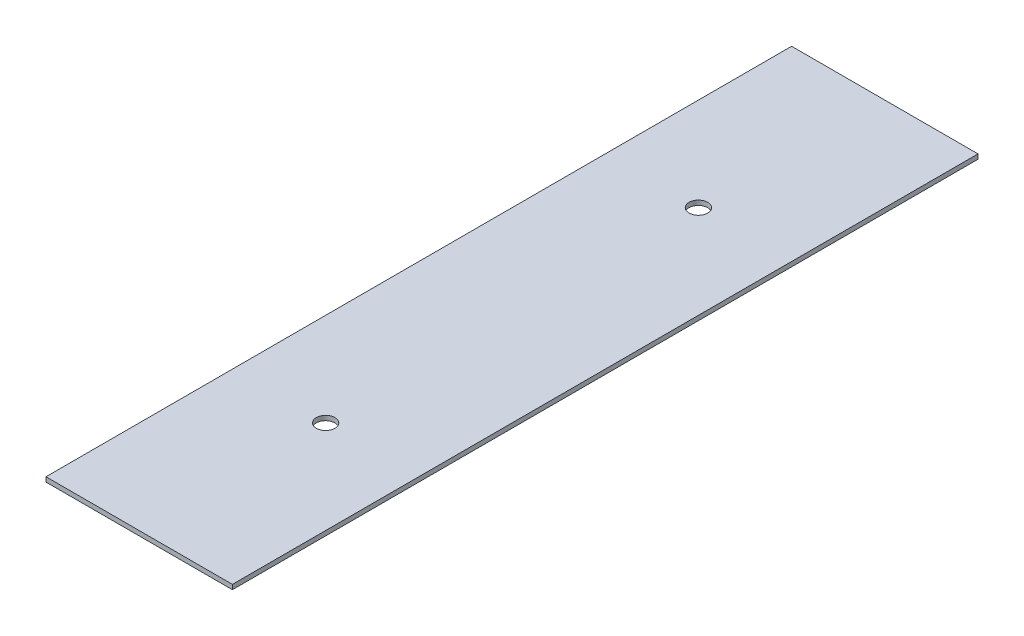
ISO-10303-21;
HEADER;
FILE_DESCRIPTION(('STEP AP214'),'2;1');
FILE_NAME('part.step','',(''),(''),'','','');
FILE_SCHEMA(('AUTOMOTIVE_DESIGN { 1 0 10303 214 1 1 1 1 }'));
ENDSEC;
DATA;
#1=APPLICATION_CONTEXT('core data for automotive mechanical design processes');
#2=APPLICATION_PROTOCOL_DEFINITION('international standard','automotive_design',2000,#1);
#3=PRODUCT_CONTEXT('',#1,'mechanical');
#4=PRODUCT('Part','Part','',(#3));
#5=PRODUCT_RELATED_PRODUCT_CATEGORY('part','',(#4));
#6=PRODUCT_DEFINITION_FORMATION('','',#4);
#7=PRODUCT_DEFINITION_CONTEXT('part definition',#1,'design');
#8=PRODUCT_DEFINITION('design','',#6,#7);
#9=PRODUCT_DEFINITION_SHAPE('','',#8);
#10=(LENGTH_UNIT() NAMED_UNIT(*) SI_UNIT(.MILLI.,.METRE.));
#11=(NAMED_UNIT(*) PLANE_ANGLE_UNIT() SI_UNIT($,.RADIAN.));
#12=(NAMED_UNIT(*) SI_UNIT($,.STERADIAN.) SOLID_ANGLE_UNIT());
#13=UNCERTAINTY_MEASURE_WITH_UNIT(LENGTH_MEASURE(1.E-05),#10,'distance_accuracy_value','');
#14=(GEOMETRIC_REPRESENTATION_CONTEXT(3) GLOBAL_UNCERTAINTY_ASSIGNED_CONTEXT((#13)) GLOBAL_UNIT_ASSIGNED_CONTEXT((#10,
#11,#12)) REPRESENTATION_CONTEXT('',''));
#15=CARTESIAN_POINT('',(0.,0.,0.));
#16=DIRECTION('',(0.,0.,1.));
#17=DIRECTION('',(1.,0.,0.));
#18=AXIS2_PLACEMENT_3D('',#15,#16,#17);
#19=CARTESIAN_POINT('',(-1270.,-1136.65,507.999999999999));
#20=DIRECTION('',(0.,-1.,0.));
#21=DIRECTION('',(0.,0.,-1.));
#22=AXIS2_PLACEMENT_3D('',#19,#20,#21);
#23=PLANE('',#22);
#24=CARTESIAN_POINT('',(-1143.,-1136.65,-253.999999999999));
#25=DIRECTION('',(0.,1.,0.));
#26=DIRECTION('',(0.,0.,-1.));
#27=AXIS2_PLACEMENT_3D('',#24,#25,#26);
#28=CIRCLE('',#27,12.6999999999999);
#29=CARTESIAN_POINT('',(-1143.,-1136.65,-266.699999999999));
#30=VERTEX_POINT('',#29);
#31=EDGE_CURVE('E131',#30,#30,#28,.T.);
#32=ORIENTED_EDGE('',*,*,#31,.F.);
#33=EDGE_LOOP('',(#32));
#34=FACE_BOUND('',#33,.T.);
#35=CARTESIAN_POINT('',(-1143.,-1136.65,253.999999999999));
#36=DIRECTION('',(0.,1.,0.));
#37=DIRECTION('',(0.,0.,1.));
#38=AXIS2_PLACEMENT_3D('',#35,#36,#37);
#39=CIRCLE('',#38,12.6999999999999);
#40=CARTESIAN_POINT('',(-1143.,-1136.65,266.699999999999));
#41=VERTEX_POINT('',#40);
#42=EDGE_CURVE('E95',#41,#41,#39,.T.);
#43=ORIENTED_EDGE('',*,*,#42,.F.);
#44=EDGE_LOOP('',(#43));
#45=FACE_BOUND('',#44,.T.);
#46=DIRECTION('',(0.,0.,-1.));
#47=VECTOR('',#46,1.);
#48=CARTESIAN_POINT('',(-1016.,-1136.65,507.999999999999));
#49=LINE('',#48,#47);
#50=CARTESIAN_POINT('',(-1016.,-1136.65,507.999999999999));
#51=VERTEX_POINT('',#50);
#52=CARTESIAN_POINT('',(-1016.,-1136.65,-507.999999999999));
#53=VERTEX_POINT('',#52);
#54=EDGE_CURVE('E91',#51,#53,#49,.T.);
#55=ORIENTED_EDGE('',*,*,#54,.T.);
#56=DIRECTION('',(-1.,0.,0.));
#57=VECTOR('',#56,1.);
#58=CARTESIAN_POINT('',(-1270.,-1136.65,-507.999999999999));
#59=LINE('',#58,#57);
#60=CARTESIAN_POINT('',(-1270.,-1136.65,-507.999999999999));
#61=VERTEX_POINT('',#60);
#62=EDGE_CURVE('E86',#53,#61,#59,.T.);
#63=ORIENTED_EDGE('',*,*,#62,.T.);
#64=DIRECTION('',(0.,0.,-1.));
#65=VECTOR('',#64,1.);
#66=CARTESIAN_POINT('',(-1270.,-1136.65,507.999999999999));
#67=LINE('',#66,#65);
#68=CARTESIAN_POINT('',(-1270.,-1136.65,507.999999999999));
#69=VERTEX_POINT('',#68);
#70=EDGE_CURVE('E11',#69,#61,#67,.T.);
#71=ORIENTED_EDGE('',*,*,#70,.F.);
#72=DIRECTION('',(-1.,0.,0.));
#73=VECTOR('',#72,1.);
#74=CARTESIAN_POINT('',(-1270.,-1136.65,507.999999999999));
#75=LINE('',#74,#73);
#76=EDGE_CURVE('E102',#51,#69,#75,.T.);
#77=ORIENTED_EDGE('',*,*,#76,.F.);
#78=EDGE_LOOP('',(#55,#63,#71,#77));
#79=FACE_BOUND('',#78,.T.);
#80=ADVANCED_FACE('F34',(#34,#45,#79),#23,.F.);
#81=CARTESIAN_POINT('',(-1270.,-1136.65,507.999999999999));
#82=DIRECTION('',(1.,0.,0.));
#83=DIRECTION('',(0.,0.,-1.));
#84=AXIS2_PLACEMENT_3D('',#81,#82,#83);
#85=PLANE('',#84);
#86=ORIENTED_EDGE('',*,*,#70,.T.);
#87=DIRECTION('',(0.,-1.,0.));
#88=VECTOR('',#87,1.);
#89=CARTESIAN_POINT('',(-1270.,-1136.65,-507.999999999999));
#90=LINE('',#89,#88);
#91=CARTESIAN_POINT('',(-1270.,-1143.,-507.999999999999));
#92=VERTEX_POINT('',#91);
#93=EDGE_CURVE('E76',#61,#92,#90,.T.);
#94=ORIENTED_EDGE('',*,*,#93,.T.);
#95=DIRECTION('',(0.,0.,-1.));
#96=VECTOR('',#95,1.);
#97=CARTESIAN_POINT('',(-1270.,-1143.,507.999999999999));
#98=LINE('',#97,#96);
#99=CARTESIAN_POINT('',(-1270.,-1143.,507.999999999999));
#100=VERTEX_POINT('',#99);
#101=EDGE_CURVE('E41',#100,#92,#98,.T.);
#102=ORIENTED_EDGE('',*,*,#101,.F.);
#103=DIRECTION('',(0.,-1.,0.));
#104=VECTOR('',#103,1.);
#105=CARTESIAN_POINT('',(-1270.,-1136.65,507.999999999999));
#106=LINE('',#105,#104);
#107=EDGE_CURVE('E77',#69,#100,#106,.T.);
#108=ORIENTED_EDGE('',*,*,#107,.F.);
#109=EDGE_LOOP('',(#86,#94,#102,#108));
#110=FACE_BOUND('',#109,.T.);
#111=ADVANCED_FACE('F74',(#110),#85,.F.);
#112=CARTESIAN_POINT('',(-1270.,-1143.,507.999999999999));
#113=DIRECTION('',(0.,1.,0.));
#114=DIRECTION('',(0.,0.,1.));
#115=AXIS2_PLACEMENT_3D('',#112,#113,#114);
#116=PLANE('',#115);
#117=CARTESIAN_POINT('',(-1143.,-1143.,-253.999999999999));
#118=DIRECTION('',(0.,1.,0.));
#119=DIRECTION('',(0.,0.,-1.));
#120=AXIS2_PLACEMENT_3D('',#117,#118,#119);
#121=CIRCLE('',#120,12.6999999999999);
#122=CARTESIAN_POINT('',(-1143.,-1143.,-266.699999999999));
#123=VERTEX_POINT('',#122);
#124=EDGE_CURVE('E135',#123,#123,#121,.T.);
#125=ORIENTED_EDGE('',*,*,#124,.T.);
#126=EDGE_LOOP('',(#125));
#127=FACE_BOUND('',#126,.T.);
#128=CARTESIAN_POINT('',(-1143.,-1143.,253.999999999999));
#129=DIRECTION('',(0.,1.,0.));
#130=DIRECTION('',(0.,0.,1.));
#131=AXIS2_PLACEMENT_3D('',#128,#129,#130);
#132=CIRCLE('',#131,12.6999999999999);
#133=CARTESIAN_POINT('',(-1143.,-1143.,266.699999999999));
#134=VERTEX_POINT('',#133);
#135=EDGE_CURVE('E92',#134,#134,#132,.T.);
#136=ORIENTED_EDGE('',*,*,#135,.T.);
#137=EDGE_LOOP('',(#136));
#138=FACE_BOUND('',#137,.T.);
#139=ORIENTED_EDGE('',*,*,#101,.T.);
#140=DIRECTION('',(1.,0.,0.));
#141=VECTOR('',#140,1.);
#142=CARTESIAN_POINT('',(-1270.,-1143.,-507.999999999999));
#143=LINE('',#142,#141);
#144=CARTESIAN_POINT('',(-1016.,-1143.,-507.999999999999));
#145=VERTEX_POINT('',#144);
#146=EDGE_CURVE('E89',#92,#145,#143,.T.);
#147=ORIENTED_EDGE('',*,*,#146,.T.);
#148=DIRECTION('',(0.,0.,-1.));
#149=VECTOR('',#148,1.);
#150=CARTESIAN_POINT('',(-1016.,-1143.,507.999999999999));
#151=LINE('',#150,#149);
#152=CARTESIAN_POINT('',(-1016.,-1143.,507.999999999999));
#153=VERTEX_POINT('',#152);
#154=EDGE_CURVE('E108',#153,#145,#151,.T.);
#155=ORIENTED_EDGE('',*,*,#154,.F.);
#156=DIRECTION('',(1.,0.,0.));
#157=VECTOR('',#156,1.);
#158=CARTESIAN_POINT('',(-1270.,-1143.,507.999999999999));
#159=LINE('',#158,#157);
#160=EDGE_CURVE('E53',#100,#153,#159,.T.);
#161=ORIENTED_EDGE('',*,*,#160,.F.);
#162=EDGE_LOOP('',(#139,#147,#155,#161));
#163=FACE_BOUND('',#162,.T.);
#164=ADVANCED_FACE('F110',(#127,#138,#163),#116,.F.);
#165=CARTESIAN_POINT('',(-1016.,-1136.65,507.999999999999));
#166=DIRECTION('',(-1.,0.,0.));
#167=DIRECTION('',(0.,0.,1.));
#168=AXIS2_PLACEMENT_3D('',#165,#166,#167);
#169=PLANE('',#168);
#170=ORIENTED_EDGE('',*,*,#154,.T.);
#171=DIRECTION('',(0.,1.,0.));
#172=VECTOR('',#171,1.);
#173=CARTESIAN_POINT('',(-1016.,-1136.65,-507.999999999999));
#174=LINE('',#173,#172);
#175=EDGE_CURVE('E100',#145,#53,#174,.T.);
#176=ORIENTED_EDGE('',*,*,#175,.T.);
#177=ORIENTED_EDGE('',*,*,#54,.F.);
#178=DIRECTION('',(0.,1.,0.));
#179=VECTOR('',#178,1.);
#180=CARTESIAN_POINT('',(-1016.,-1136.65,507.999999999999));
#181=LINE('',#180,#179);
#182=EDGE_CURVE('E48',#153,#51,#181,.T.);
#183=ORIENTED_EDGE('',*,*,#182,.F.);
#184=EDGE_LOOP('',(#170,#176,#177,#183));
#185=FACE_BOUND('',#184,.T.);
#186=ADVANCED_FACE('F112',(#185),#169,.F.);
#187=CARTESIAN_POINT('',(-1016.,-1136.65,507.999999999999));
#188=DIRECTION('',(0.,0.,-1.));
#189=DIRECTION('',(-1.,0.,0.));
#190=AXIS2_PLACEMENT_3D('',#187,#188,#189);
#191=PLANE('',#190);
#192=ORIENTED_EDGE('',*,*,#76,.T.);
#193=ORIENTED_EDGE('',*,*,#107,.T.);
#194=ORIENTED_EDGE('',*,*,#160,.T.);
#195=ORIENTED_EDGE('',*,*,#182,.T.);
#196=EDGE_LOOP('',(#192,#193,#194,#195));
#197=FACE_BOUND('',#196,.T.);
#198=ADVANCED_FACE('F113',(#197),#191,.F.);
#199=CARTESIAN_POINT('',(-1016.,-1136.65,-507.999999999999));
#200=DIRECTION('',(0.,0.,-1.));
#201=DIRECTION('',(-1.,0.,0.));
#202=AXIS2_PLACEMENT_3D('',#199,#200,#201);
#203=PLANE('',#202);
#204=ORIENTED_EDGE('',*,*,#62,.F.);
#205=ORIENTED_EDGE('',*,*,#175,.F.);
#206=ORIENTED_EDGE('',*,*,#146,.F.);
#207=ORIENTED_EDGE('',*,*,#93,.F.);
#208=EDGE_LOOP('',(#204,#205,#206,#207));
#209=FACE_BOUND('',#208,.T.);
#210=ADVANCED_FACE('F84',(#209),#203,.T.);
#211=CARTESIAN_POINT('',(-1143.,-1143.,253.999999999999));
#212=DIRECTION('',(0.,1.,0.));
#213=DIRECTION('',(0.,0.,1.));
#214=AXIS2_PLACEMENT_3D('',#211,#212,#213);
#215=CYLINDRICAL_SURFACE('',#214,12.6999999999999);
#216=ORIENTED_EDGE('',*,*,#135,.F.);
#217=EDGE_LOOP('',(#216));
#218=FACE_BOUND('',#217,.T.);
#219=ORIENTED_EDGE('',*,*,#42,.T.);
#220=EDGE_LOOP('',(#219));
#221=FACE_BOUND('',#220,.T.);
#222=ADVANCED_FACE('F120',(#218,#221),#215,.F.);
#223=CARTESIAN_POINT('',(-1143.,-1143.,-253.999999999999));
#224=DIRECTION('',(0.,1.,0.));
#225=DIRECTION('',(0.,0.,1.));
#226=AXIS2_PLACEMENT_3D('',#223,#224,#225);
#227=CYLINDRICAL_SURFACE('',#226,12.6999999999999);
#228=ORIENTED_EDGE('',*,*,#124,.F.);
#229=EDGE_LOOP('',(#228));
#230=FACE_BOUND('',#229,.T.);
#231=ORIENTED_EDGE('',*,*,#31,.T.);
#232=EDGE_LOOP('',(#231));
#233=FACE_BOUND('',#232,.T.);
#234=ADVANCED_FACE('F142',(#230,#233),#227,.F.);
#235=CLOSED_SHELL('',(#80,#111,#164,#186,#198,#210,#222,#234));
#236=MANIFOLD_SOLID_BREP('B2',#235);
#237=ADVANCED_BREP_SHAPE_REPRESENTATION('',(#18,#236),#14);
#238=SHAPE_DEFINITION_REPRESENTATION(#9,#237);
ENDSEC;
END-ISO-10303-21;
